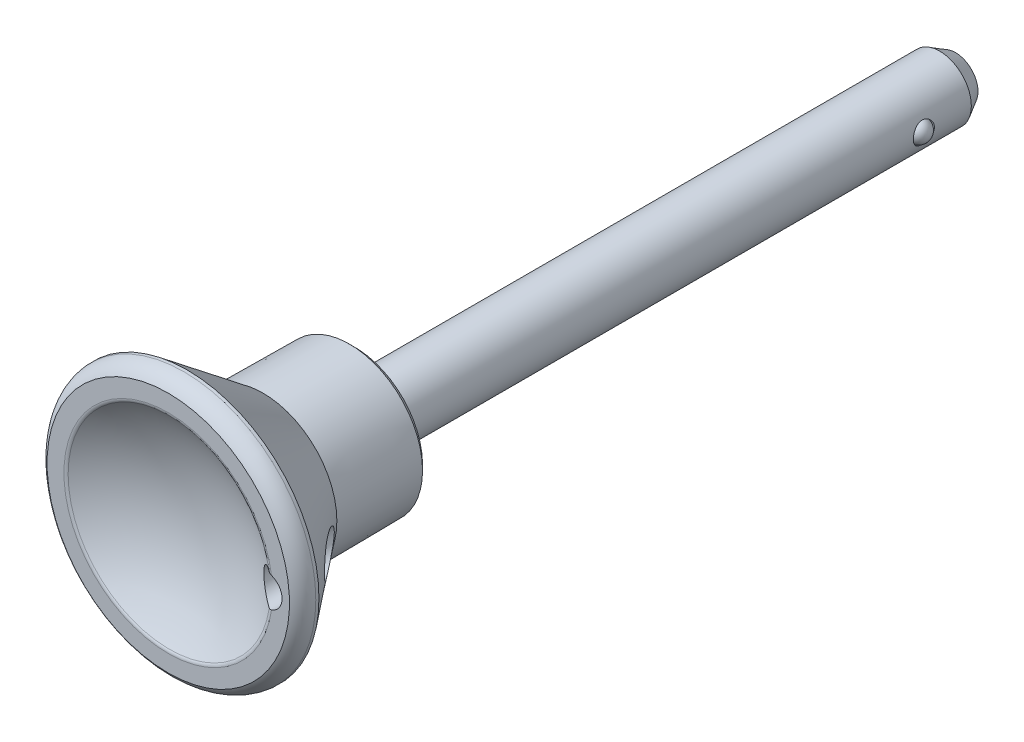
ISO-10303-21;
HEADER;
FILE_DESCRIPTION(('STEP AP214'),'2;1');
FILE_NAME('part.step','',(''),(''),'','','');
FILE_SCHEMA(('AUTOMOTIVE_DESIGN { 1 0 10303 214 1 1 1 1 }'));
ENDSEC;
DATA;
#1=APPLICATION_CONTEXT('core data for automotive mechanical design processes');
#2=APPLICATION_PROTOCOL_DEFINITION('international standard','automotive_design',2000,#1);
#3=PRODUCT_CONTEXT('',#1,'mechanical');
#4=PRODUCT('Part','Part','',(#3));
#5=PRODUCT_RELATED_PRODUCT_CATEGORY('part','',(#4));
#6=PRODUCT_DEFINITION_FORMATION('','',#4);
#7=PRODUCT_DEFINITION_CONTEXT('part definition',#1,'design');
#8=PRODUCT_DEFINITION('design','',#6,#7);
#9=PRODUCT_DEFINITION_SHAPE('','',#8);
#10=(LENGTH_UNIT() NAMED_UNIT(*) SI_UNIT(.MILLI.,.METRE.));
#11=(NAMED_UNIT(*) PLANE_ANGLE_UNIT() SI_UNIT($,.RADIAN.));
#12=(NAMED_UNIT(*) SI_UNIT($,.STERADIAN.) SOLID_ANGLE_UNIT());
#13=UNCERTAINTY_MEASURE_WITH_UNIT(LENGTH_MEASURE(1.E-05),#10,'distance_accuracy_value','');
#14=(GEOMETRIC_REPRESENTATION_CONTEXT(3) GLOBAL_UNCERTAINTY_ASSIGNED_CONTEXT((#13)) GLOBAL_UNIT_ASSIGNED_CONTEXT((#10,
#11,#12)) REPRESENTATION_CONTEXT('',''));
#15=CARTESIAN_POINT('',(0.,0.,0.));
#16=DIRECTION('',(0.,0.,1.));
#17=DIRECTION('',(1.,0.,0.));
#18=AXIS2_PLACEMENT_3D('',#15,#16,#17);
#19=CARTESIAN_POINT('',(0.,0.,0.));
#20=DIRECTION('',(0.,0.,1.));
#21=DIRECTION('',(0.,-1.,0.));
#22=AXIS2_PLACEMENT_3D('',#19,#20,#21);
#23=CYLINDRICAL_SURFACE('',#22,3.);
#24=CARTESIAN_POINT('',(0.,0.,0.));
#25=DIRECTION('',(0.,0.,1.));
#26=DIRECTION('',(0.,-1.,0.));
#27=AXIS2_PLACEMENT_3D('',#24,#25,#26);
#28=CIRCLE('',#27,3.);
#29=CARTESIAN_POINT('',(0.,-3.,0.));
#30=VERTEX_POINT('',#29);
#31=EDGE_CURVE('E18',#30,#30,#28,.T.);
#32=ORIENTED_EDGE('',*,*,#31,.F.);
#33=EDGE_LOOP('',(#32));
#34=FACE_BOUND('',#33,.T.);
#35=CARTESIAN_POINT('',(0.,0.,-55.5));
#36=DIRECTION('',(0.,0.,1.));
#37=DIRECTION('',(1.,0.,0.));
#38=AXIS2_PLACEMENT_3D('',#35,#36,#37);
#39=CIRCLE('',#38,3.);
#40=CARTESIAN_POINT('',(3.,0.,-55.5));
#41=VERTEX_POINT('',#40);
#42=EDGE_CURVE('E115',#41,#41,#39,.T.);
#43=ORIENTED_EDGE('',*,*,#42,.T.);
#44=EDGE_LOOP('',(#43));
#45=FACE_BOUND('',#44,.T.);
#46=CARTESIAN_POINT('',(3.,0.,-52.));
#47=CARTESIAN_POINT('',(2.99999782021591,-0.0544873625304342,-51.9999969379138));
#48=CARTESIAN_POINT('',(2.99849945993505,-0.109030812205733,-51.9955259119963));
#49=CARTESIAN_POINT('',(2.99265949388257,-0.216567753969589,-51.9777925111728));
#50=CARTESIAN_POINT('',(2.98831315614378,-0.269558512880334,-51.9645155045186));
#51=CARTESIAN_POINT('',(2.9772520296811,-0.372338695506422,-51.9296777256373));
#52=CARTESIAN_POINT('',(2.97054267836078,-0.422135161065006,-51.9081359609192));
#53=CARTESIAN_POINT('',(2.95544181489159,-0.517390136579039,-51.8574495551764));
#54=CARTESIAN_POINT('',(2.94705050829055,-0.562849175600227,-51.8283058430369));
#55=CARTESIAN_POINT('',(2.9291411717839,-0.649740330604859,-51.7621750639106));
#56=CARTESIAN_POINT('',(2.9195960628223,-0.691001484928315,-51.7249707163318));
#57=CARTESIAN_POINT('',(2.90060364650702,-0.766830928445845,-51.6442351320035));
#58=CARTESIAN_POINT('',(2.89115636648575,-0.801397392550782,-51.6007021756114));
#59=CARTESIAN_POINT('',(2.87313330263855,-0.863825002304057,-51.5070147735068));
#60=CARTESIAN_POINT('',(2.86459035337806,-0.891464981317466,-51.4567060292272));
#61=CARTESIAN_POINT('',(2.84975302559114,-0.937818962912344,-51.3518236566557));
#62=CARTESIAN_POINT('',(2.84345795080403,-0.956535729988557,-51.2972513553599));
#63=CARTESIAN_POINT('',(2.834113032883,-0.983873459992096,-51.187326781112));
#64=CARTESIAN_POINT('',(2.83096095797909,-0.992813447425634,-51.1320627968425));
#65=CARTESIAN_POINT('',(2.82795656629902,-1.00134112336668,-51.020736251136));
#66=CARTESIAN_POINT('',(2.82810323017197,-1.00093170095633,-50.9646739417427));
#67=CARTESIAN_POINT('',(2.83159014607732,-0.991019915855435,-50.8560634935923));
#68=CARTESIAN_POINT('',(2.83478414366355,-0.981933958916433,-50.8034718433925));
#69=CARTESIAN_POINT('',(2.84376655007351,-0.955606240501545,-50.7006068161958));
#70=CARTESIAN_POINT('',(2.84955528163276,-0.938363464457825,-50.6503337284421));
#71=CARTESIAN_POINT('',(2.86317929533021,-0.895938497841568,-50.5525859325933));
#72=CARTESIAN_POINT('',(2.87104608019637,-0.870632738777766,-50.5051694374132));
#73=CARTESIAN_POINT('',(2.88792606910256,-0.812887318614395,-50.4151267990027));
#74=CARTESIAN_POINT('',(2.89693954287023,-0.78044597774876,-50.3725017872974));
#75=CARTESIAN_POINT('',(2.91567165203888,-0.70735591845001,-50.2909155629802));
#76=CARTESIAN_POINT('',(2.92540257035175,-0.666367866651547,-50.2522605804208));
#77=CARTESIAN_POINT('',(2.94406631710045,-0.578354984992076,-50.1822794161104));
#78=CARTESIAN_POINT('',(2.95299879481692,-0.531327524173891,-50.1509564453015));
#79=CARTESIAN_POINT('',(2.96917806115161,-0.431907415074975,-50.0962803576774));
#80=CARTESIAN_POINT('',(2.97640595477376,-0.379463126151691,-50.073015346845));
#81=CARTESIAN_POINT('',(2.98821351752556,-0.271163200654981,-50.0357719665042));
#82=CARTESIAN_POINT('',(2.99279860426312,-0.215314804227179,-50.0217745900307));
#83=CARTESIAN_POINT('',(2.99719039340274,-0.132457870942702,-50.0084544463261));
#84=CARTESIAN_POINT('',(2.99824082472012,-0.106081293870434,-50.0052879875));
#85=CARTESIAN_POINT('',(2.9996461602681,-0.0531409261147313,-50.0010600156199));
#86=CARTESIAN_POINT('',(3.00000106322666,-0.026577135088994,-49.9999985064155));
#87=CARTESIAN_POINT('',(2.99999782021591,0.0544873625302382,-50.0000030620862));
#88=CARTESIAN_POINT('',(2.99849945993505,0.109030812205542,-50.0044740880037));
#89=CARTESIAN_POINT('',(2.99265949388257,0.216567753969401,-50.0222074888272));
#90=CARTESIAN_POINT('',(2.98831315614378,0.269558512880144,-50.0354844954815));
#91=CARTESIAN_POINT('',(2.9772520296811,0.372338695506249,-50.0703222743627));
#92=CARTESIAN_POINT('',(2.97054267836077,0.422135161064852,-50.0918640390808));
#93=CARTESIAN_POINT('',(2.95544181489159,0.517390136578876,-50.1425504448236));
#94=CARTESIAN_POINT('',(2.94705050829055,0.562849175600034,-50.1716941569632));
#95=CARTESIAN_POINT('',(2.9291411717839,0.64974033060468,-50.2378249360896));
#96=CARTESIAN_POINT('',(2.91959606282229,0.691001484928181,-50.2750292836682));
#97=CARTESIAN_POINT('',(2.900603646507,0.766830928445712,-50.3557648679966));
#98=CARTESIAN_POINT('',(2.89115636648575,0.801397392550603,-50.3992978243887));
#99=CARTESIAN_POINT('',(2.87313330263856,0.863825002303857,-50.4929852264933));
#100=CARTESIAN_POINT('',(2.86459035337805,0.891464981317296,-50.5432939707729));
#101=CARTESIAN_POINT('',(2.84975302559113,0.937818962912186,-50.6481763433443));
#102=CARTESIAN_POINT('',(2.84345795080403,0.956535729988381,-50.7027486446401));
#103=CARTESIAN_POINT('',(2.834113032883,0.983873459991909,-50.812673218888));
#104=CARTESIAN_POINT('',(2.83096095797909,0.992813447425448,-50.8679372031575));
#105=CARTESIAN_POINT('',(2.82795656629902,1.0013411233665,-50.979263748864));
#106=CARTESIAN_POINT('',(2.82810323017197,1.00093170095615,-51.0353260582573));
#107=CARTESIAN_POINT('',(2.83159014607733,0.991019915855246,-51.1439365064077));
#108=CARTESIAN_POINT('',(2.83478414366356,0.981933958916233,-51.1965281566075));
#109=CARTESIAN_POINT('',(2.84376655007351,0.955606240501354,-51.2993931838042));
#110=CARTESIAN_POINT('',(2.84955528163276,0.938363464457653,-51.349666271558));
#111=CARTESIAN_POINT('',(2.8631792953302,0.895938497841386,-51.4474140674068));
#112=CARTESIAN_POINT('',(2.87104608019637,0.87063273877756,-51.4948305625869));
#113=CARTESIAN_POINT('',(2.88792606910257,0.812887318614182,-51.5848732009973));
#114=CARTESIAN_POINT('',(2.89693954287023,0.780445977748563,-51.6274982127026));
#115=CARTESIAN_POINT('',(2.91567165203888,0.707355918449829,-51.7090844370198));
#116=CARTESIAN_POINT('',(2.92540257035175,0.666367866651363,-51.7477394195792));
#117=CARTESIAN_POINT('',(2.94406631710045,0.578354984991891,-51.8177205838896));
#118=CARTESIAN_POINT('',(2.95299879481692,0.531327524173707,-51.8490435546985));
#119=CARTESIAN_POINT('',(2.96917806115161,0.431907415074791,-51.9037196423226));
#120=CARTESIAN_POINT('',(2.97640595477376,0.379463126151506,-51.926984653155));
#121=CARTESIAN_POINT('',(2.98821351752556,0.271163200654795,-51.9642280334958));
#122=CARTESIAN_POINT('',(2.99279860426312,0.215314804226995,-51.9782254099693));
#123=CARTESIAN_POINT('',(2.99719039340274,0.132457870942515,-51.9915455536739));
#124=CARTESIAN_POINT('',(2.99824082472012,0.106081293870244,-51.9947120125));
#125=CARTESIAN_POINT('',(2.9996461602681,0.0531409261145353,-51.9989399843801));
#126=CARTESIAN_POINT('',(3.00000106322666,0.0265771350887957,-52.0000014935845));
#127=CARTESIAN_POINT('',(3.,0.,-52.));
#128=B_SPLINE_CURVE_WITH_KNOTS('',3,(#46,#47,#48,#49,#50,#51,#52,#53,#54,#55,#56,#57,#58,#59,
#60,#61,#62,#63,#64,#65,#66,#67,#68,#69,#70,#71,#72,#73,#74,#75,#76,#77,#78,#79,#80,#81,#82,#83,
#84,#85,#86,#87,#88,#89,#90,#91,#92,#93,#94,#95,#96,#97,#98,#99,#100,#101,#102,#103,#104,#105,
#106,#107,#108,#109,#110,#111,#112,#113,#114,#115,#116,#117,#118,#119,#120,#121,#122,#123,#124,
#125,#126,#127),.UNSPECIFIED.,.T.,.F.,(4,2,2,2,2,2,2,2,2,2,2,2,2,2,2,2,2,2,2,2,2,2,2,2,2,2,2,2,
2,2,2,2,2,2,2,2,2,2,2,2,4),(0.,0.16335953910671,0.326991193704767,0.490248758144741,
0.6534863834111,0.821842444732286,0.990244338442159,1.16348424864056,1.33667045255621,
1.50401925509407,1.67131634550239,1.83096789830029,1.99063931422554,2.152886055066,
2.31517103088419,2.48590393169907,2.65671146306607,2.82933165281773,3.00159671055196,
3.08127795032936,3.16095933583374,3.32431887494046,3.48795052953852,3.65120809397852,
3.81444571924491,3.9828017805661,4.15120367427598,4.32444358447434,4.49762978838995,
4.6649785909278,4.83227568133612,4.99192723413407,5.15159865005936,5.31384539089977,
5.47613036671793,5.6468632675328,5.81767079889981,5.99029098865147,6.1625560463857,
6.24223728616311,6.32191867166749),.UNSPECIFIED.);
#129=CARTESIAN_POINT('',(3.,0.,-52.));
#130=VERTEX_POINT('',#129);
#131=EDGE_CURVE('E159',#130,#130,#128,.T.);
#132=ORIENTED_EDGE('',*,*,#131,.T.);
#133=EDGE_LOOP('',(#132));
#134=FACE_BOUND('',#133,.T.);
#135=ADVANCED_FACE('F15',(#34,#45,#134),#23,.T.);
#136=CARTESIAN_POINT('',(6.4240762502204,-6.50116727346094,0.));
#137=DIRECTION('',(0.,0.,-1.));
#138=DIRECTION('',(-1.,0.,0.));
#139=AXIS2_PLACEMENT_3D('',#136,#137,#138);
#140=PLANE('',#139);
#141=ORIENTED_EDGE('',*,*,#31,.T.);
#142=EDGE_LOOP('',(#141));
#143=FACE_BOUND('',#142,.T.);
#144=CARTESIAN_POINT('',(0.,0.,0.));
#145=DIRECTION('',(0.,0.,1.));
#146=DIRECTION('',(0.,-1.,0.));
#147=AXIS2_PLACEMENT_3D('',#144,#145,#146);
#148=CIRCLE('',#147,6.4240762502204);
#149=CARTESIAN_POINT('',(0.,-6.4240762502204,0.));
#150=VERTEX_POINT('',#149);
#151=EDGE_CURVE('E103',#150,#150,#148,.T.);
#152=ORIENTED_EDGE('',*,*,#151,.F.);
#153=EDGE_LOOP('',(#152));
#154=FACE_BOUND('',#153,.T.);
#155=ADVANCED_FACE('F184',(#143,#154),#140,.T.);
#156=CARTESIAN_POINT('',(0.,0.,0.));
#157=DIRECTION('',(0.,0.,1.));
#158=DIRECTION('',(0.,-1.,0.));
#159=AXIS2_PLACEMENT_3D('',#156,#157,#158);
#160=CONICAL_SURFACE('',#159,6.4240762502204,0.789761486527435);
#161=CARTESIAN_POINT('',(0.,0.,0.499980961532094));
#162=DIRECTION('',(0.,0.,-1.));
#163=DIRECTION('',(1.,0.,0.));
#164=AXIS2_PLACEMENT_3D('',#161,#162,#163);
#165=CIRCLE('',#164,6.92843951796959);
#166=CARTESIAN_POINT('',(6.92843951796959,0.,0.499980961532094));
#167=VERTEX_POINT('',#166);
#168=EDGE_CURVE('E134',#167,#167,#165,.F.);
#169=ORIENTED_EDGE('',*,*,#168,.F.);
#170=EDGE_LOOP('',(#169));
#171=FACE_BOUND('',#170,.T.);
#172=ORIENTED_EDGE('',*,*,#151,.T.);
#173=EDGE_LOOP('',(#172));
#174=FACE_BOUND('',#173,.T.);
#175=ADVANCED_FACE('F189',(#171,#174),#160,.T.);
#176=CARTESIAN_POINT('',(0.,0.,0.499980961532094));
#177=DIRECTION('',(0.,0.,1.));
#178=DIRECTION('',(0.,-1.,0.));
#179=AXIS2_PLACEMENT_3D('',#176,#177,#178);
#180=CONICAL_SURFACE('',#179,6.92843951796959,0.00872664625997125);
#181=CARTESIAN_POINT('',(0.,0.,8.7));
#182=DIRECTION('',(0.,0.,-1.));
#183=DIRECTION('',(1.,0.,0.));
#184=AXIS2_PLACEMENT_3D('',#181,#182,#183);
#185=CIRCLE('',#184,7.);
#186=CARTESIAN_POINT('',(7.,0.,8.7));
#187=VERTEX_POINT('',#186);
#188=EDGE_CURVE('E129',#187,#187,#185,.F.);
#189=ORIENTED_EDGE('',*,*,#188,.F.);
#190=EDGE_LOOP('',(#189));
#191=FACE_BOUND('',#190,.T.);
#192=ORIENTED_EDGE('',*,*,#168,.T.);
#193=EDGE_LOOP('',(#192));
#194=FACE_BOUND('',#193,.T.);
#195=ADVANCED_FACE('F201',(#191,#194),#180,.T.);
#196=CARTESIAN_POINT('',(0.,0.,16.2));
#197=DIRECTION('',(0.,0.,1.));
#198=DIRECTION('',(0.,-1.,0.));
#199=AXIS2_PLACEMENT_3D('',#196,#197,#198);
#200=CYLINDRICAL_SURFACE('',#199,12.5);
#201=CARTESIAN_POINT('',(0.,0.,15.9));
#202=DIRECTION('',(0.,0.,-1.));
#203=DIRECTION('',(1.,0.,0.));
#204=AXIS2_PLACEMENT_3D('',#201,#202,#203);
#205=CIRCLE('',#204,12.5);
#206=CARTESIAN_POINT('',(12.5,0.,15.9));
#207=VERTEX_POINT('',#206);
#208=EDGE_CURVE('E130',#207,#207,#205,.T.);
#209=ORIENTED_EDGE('',*,*,#208,.F.);
#210=EDGE_LOOP('',(#209));
#211=FACE_BOUND('',#210,.T.);
#212=CARTESIAN_POINT('',(0.,0.,16.2));
#213=DIRECTION('',(0.,0.,1.));
#214=DIRECTION('',(0.,-1.,0.));
#215=AXIS2_PLACEMENT_3D('',#212,#213,#214);
#216=CIRCLE('',#215,12.5);
#217=CARTESIAN_POINT('',(0.,-12.5,16.2));
#218=VERTEX_POINT('',#217);
#219=EDGE_CURVE('E102',#218,#218,#216,.T.);
#220=ORIENTED_EDGE('',*,*,#219,.F.);
#221=EDGE_LOOP('',(#220));
#222=FACE_BOUND('',#221,.T.);
#223=ADVANCED_FACE('F208',(#211,#222),#200,.T.);
#224=CARTESIAN_POINT('',(0.,0.,8.7));
#225=DIRECTION('',(0.,0.,1.));
#226=DIRECTION('',(0.,-1.,0.));
#227=AXIS2_PLACEMENT_3D('',#224,#225,#226);
#228=CONICAL_SURFACE('',#227,7.,0.65233090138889);
#229=CARTESIAN_POINT('',(9.05806451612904,-1.48036050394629,11.5515077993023));
#230=CARTESIAN_POINT('',(8.99141512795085,-1.46946825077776,11.4631001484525));
#231=CARTESIAN_POINT('',(8.92550148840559,-1.45408557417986,11.3746905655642));
#232=CARTESIAN_POINT('',(8.7955636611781,-1.41427171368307,11.1984472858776));
#233=CARTESIAN_POINT('',(8.73154031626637,-1.38983655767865,11.1106138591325));
#234=CARTESIAN_POINT('',(8.60623315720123,-1.33170423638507,10.936758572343));
#235=CARTESIAN_POINT('',(8.54493725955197,-1.29805393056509,10.8507298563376));
#236=CARTESIAN_POINT('',(8.42544336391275,-1.22074353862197,10.6811358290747));
#237=CARTESIAN_POINT('',(8.36724184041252,-1.17709515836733,10.5975677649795));
#238=CARTESIAN_POINT('',(8.26922940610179,-1.09114708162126,10.4552980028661));
#239=CARTESIAN_POINT('',(8.22852162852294,-1.05135683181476,10.3957022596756));
#240=CARTESIAN_POINT('',(8.14989980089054,-0.964725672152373,10.2796936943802));
#241=CARTESIAN_POINT('',(8.11198828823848,-0.917878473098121,10.2232837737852));
#242=CARTESIAN_POINT('',(8.03963417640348,-0.81574430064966,10.1148327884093));
#243=CARTESIAN_POINT('',(8.00522654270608,-0.760383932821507,10.0628364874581));
#244=CARTESIAN_POINT('',(7.94192848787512,-0.640477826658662,9.96655825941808));
#245=CARTESIAN_POINT('',(7.91302454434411,-0.5759552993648,9.92225744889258));
#246=CARTESIAN_POINT('',(7.87251252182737,-0.463057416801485,9.85986137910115));
#247=CARTESIAN_POINT('',(7.85846623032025,-0.417573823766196,9.8381417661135));
#248=CARTESIAN_POINT('',(7.83441768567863,-0.323152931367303,9.80086955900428));
#249=CARTESIAN_POINT('',(7.82440740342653,-0.274222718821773,9.78530472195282));
#250=CARTESIAN_POINT('',(7.81132335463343,-0.187620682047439,9.76493500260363));
#251=CARTESIAN_POINT('',(7.80710048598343,-0.15053785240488,9.7583503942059));
#252=CARTESIAN_POINT('',(7.80143783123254,-0.075641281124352,9.74951765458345));
#253=CARTESIAN_POINT('',(7.79999798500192,-0.0378275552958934,9.7472694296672));
#254=CARTESIAN_POINT('',(7.8000025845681,0.0485200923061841,9.74727695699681));
#255=CARTESIAN_POINT('',(7.80237736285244,0.0970629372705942,9.75098545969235));
#256=CARTESIAN_POINT('',(7.81164444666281,0.192651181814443,9.76543406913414));
#257=CARTESIAN_POINT('',(7.81854204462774,0.239694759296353,9.77618241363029));
#258=CARTESIAN_POINT('',(7.83829683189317,0.341610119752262,9.80688772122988));
#259=CARTESIAN_POINT('',(7.85215507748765,0.395817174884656,9.82838678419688));
#260=CARTESIAN_POINT('',(7.8845198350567,0.499375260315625,9.87838349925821));
#261=CARTESIAN_POINT('',(7.90303499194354,0.548717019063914,9.9068941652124));
#262=CARTESIAN_POINT('',(7.95423062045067,0.667068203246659,9.98533549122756));
#263=CARTESIAN_POINT('',(7.98924354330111,0.732796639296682,10.0386516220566));
#264=CARTESIAN_POINT('',(8.06472209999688,0.853932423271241,10.1525776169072));
#265=CARTESIAN_POINT('',(8.10520064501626,0.909314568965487,10.2132047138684));
#266=CARTESIAN_POINT('',(8.18383548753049,1.00367842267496,10.3298982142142));
#267=CARTESIAN_POINT('',(8.22147534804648,1.04387385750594,10.3853483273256));
#268=CARTESIAN_POINT('',(8.29898008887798,1.1184153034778,10.4986148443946));
#269=CARTESIAN_POINT('',(8.33884646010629,1.15275733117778,10.556432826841));
#270=CARTESIAN_POINT('',(8.42042546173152,1.21614962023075,10.6737908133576));
#271=CARTESIAN_POINT('',(8.46214099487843,1.24519116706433,10.7333334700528));
#272=CARTESIAN_POINT('',(8.54706483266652,1.29830522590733,10.8535675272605));
#273=CARTESIAN_POINT('',(8.59027353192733,1.32237641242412,10.9142592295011));
#274=CARTESIAN_POINT('',(8.69675324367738,1.37513054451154,11.0626135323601));
#275=CARTESIAN_POINT('',(8.7606819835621,1.40136483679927,11.150681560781));
#276=CARTESIAN_POINT('',(8.89058399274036,1.44466814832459,11.3275915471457));
#277=CARTESIAN_POINT('',(8.95655819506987,1.46173291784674,11.4164338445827));
#278=CARTESIAN_POINT('',(9.09008194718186,1.48679092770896,11.5942301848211));
#279=CARTESIAN_POINT('',(9.15763151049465,1.49478409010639,11.683184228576));
#280=CARTESIAN_POINT('',(9.293788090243,1.50153429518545,11.8605390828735));
#281=CARTESIAN_POINT('',(9.36239469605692,1.50029483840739,11.9489400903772));
#282=CARTESIAN_POINT('',(9.53896432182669,1.48478544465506,12.1740527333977));
#283=CARTESIAN_POINT('',(9.64741582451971,1.46359594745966,12.3100469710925));
#284=CARTESIAN_POINT('',(9.80896256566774,1.41213790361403,12.5095339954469));
#285=CARTESIAN_POINT('',(9.86259038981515,1.39172486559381,12.5752398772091));
#286=CARTESIAN_POINT('',(9.96902195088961,1.34380635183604,12.7046889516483));
#287=CARTESIAN_POINT('',(10.021826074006,1.31630431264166,12.7684330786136));
#288=CARTESIAN_POINT('',(10.1398540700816,1.24522266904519,12.9099256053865));
#289=CARTESIAN_POINT('',(10.2046458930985,1.1993124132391,12.9868895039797));
#290=CARTESIAN_POINT('',(10.3299573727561,1.09357010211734,13.1345591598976));
#291=CARTESIAN_POINT('',(10.3904821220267,1.03375502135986,13.2052724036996));
#292=CARTESIAN_POINT('',(10.4895745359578,0.916081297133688,13.3202576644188));
#293=CARTESIAN_POINT('',(10.5297805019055,0.861692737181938,13.3666468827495));
#294=CARTESIAN_POINT('',(10.6043536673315,0.743973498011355,13.452316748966));
#295=CARTESIAN_POINT('',(10.6387288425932,0.680655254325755,13.4916071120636));
#296=CARTESIAN_POINT('',(10.6925693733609,0.560424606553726,13.5529446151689));
#297=CARTESIAN_POINT('',(10.7136506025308,0.505208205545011,13.5768833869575));
#298=CARTESIAN_POINT('',(10.7495749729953,0.390302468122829,13.6176027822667));
#299=CARTESIAN_POINT('',(10.7644289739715,0.330621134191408,13.6343958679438));
#300=CARTESIAN_POINT('',(10.7836092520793,0.225596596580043,13.656059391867));
#301=CARTESIAN_POINT('',(10.7897268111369,0.180990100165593,13.6629607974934));
#302=CARTESIAN_POINT('',(10.7979243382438,0.0909301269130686,13.6722061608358));
#303=CARTESIAN_POINT('',(10.8000037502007,0.0454765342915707,13.6745494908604));
#304=CARTESIAN_POINT('',(10.799994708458,-0.0641674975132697,13.6745397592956));
#305=CARTESIAN_POINT('',(10.795841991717,-0.128380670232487,13.6698606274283));
#306=CARTESIAN_POINT('',(10.7796239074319,-0.254506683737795,13.6515601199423));
#307=CARTESIAN_POINT('',(10.7675483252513,-0.31641644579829,13.6379272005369));
#308=CARTESIAN_POINT('',(10.7366563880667,-0.435644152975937,13.6029693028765));
#309=CARTESIAN_POINT('',(10.7178919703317,-0.492993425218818,13.5817035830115));
#310=CARTESIAN_POINT('',(10.6748799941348,-0.602645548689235,13.532811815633));
#311=CARTESIAN_POINT('',(10.6506301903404,-0.654946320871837,13.5051831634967));
#312=CARTESIAN_POINT('',(10.5859735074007,-0.77647271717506,13.4312530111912));
#313=CARTESIAN_POINT('',(10.5432056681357,-0.842728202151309,13.3821425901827));
#314=CARTESIAN_POINT('',(10.4516580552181,-0.964099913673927,13.2763616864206));
#315=CARTESIAN_POINT('',(10.4028645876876,-1.01918998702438,13.2196739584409));
#316=CARTESIAN_POINT('',(10.2766029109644,-1.14345503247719,13.0719673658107));
#317=CARTESIAN_POINT('',(10.1967753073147,-1.20635475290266,12.9777102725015));
#318=CARTESIAN_POINT('',(10.0329696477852,-1.31236147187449,12.7820645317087));
#319=CARTESIAN_POINT('',(9.94898466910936,-1.35543413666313,12.6806638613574));
#320=CARTESIAN_POINT('',(9.79718248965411,-1.41705079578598,12.4951419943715));
#321=CARTESIAN_POINT('',(9.72964852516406,-1.43883766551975,12.4118303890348));
#322=CARTESIAN_POINT('',(9.59439459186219,-1.47247845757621,12.2433068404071));
#323=CARTESIAN_POINT('',(9.52667453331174,-1.48432617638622,12.1580937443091));
#324=CARTESIAN_POINT('',(9.39151350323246,-1.49875216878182,11.9862568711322));
#325=CARTESIAN_POINT('',(9.32407407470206,-1.50130123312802,11.8996295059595));
#326=CARTESIAN_POINT('',(9.19020636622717,-1.49747387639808,11.725837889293));
#327=CARTESIAN_POINT('',(9.12377782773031,-1.49109977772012,11.6386737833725));
#328=CARTESIAN_POINT('',(9.05806451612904,-1.48036050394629,11.5515077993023));
#329=B_SPLINE_CURVE_WITH_KNOTS('',3,(#229,#230,#231,#232,#233,#234,#235,#236,#237,#238,#239,
#240,#241,#242,#243,#244,#245,#246,#247,#248,#249,#250,#251,#252,#253,#254,#255,#256,#257,#258,
#259,#260,#261,#262,#263,#264,#265,#266,#267,#268,#269,#270,#271,#272,#273,#274,#275,#276,#277,
#278,#279,#280,#281,#282,#283,#284,#285,#286,#287,#288,#289,#290,#291,#292,#293,#294,#295,#296,
#297,#298,#299,#300,#301,#302,#303,#304,#305,#306,#307,#308,#309,#310,#311,#312,#313,#314,#315,
#316,#317,#318,#319,#320,#321,#322,#323,#324,#325,#326,#327,#328),.UNSPECIFIED.,.T.,.F.,(4,2,2,
2,2,2,2,2,2,2,2,2,2,2,2,2,2,2,2,2,2,2,2,2,2,2,2,2,2,2,2,2,2,2,2,2,2,2,2,2,2,2,2,2,2,2,2,2,2,4),
(0.,0.333658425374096,0.667463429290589,0.999601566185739,1.33135280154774,1.57826788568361,
1.82540433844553,2.07480511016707,2.32358497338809,2.48005639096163,2.63621497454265,
2.74958301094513,2.86294859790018,3.00835870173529,3.15393926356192,3.33275537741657,
3.51190592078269,3.78514778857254,4.05904679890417,4.2931693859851,4.52745067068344,
4.76211373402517,4.9968392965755,5.33221840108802,5.66775280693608,6.0032900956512,
6.33870017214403,6.86226215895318,7.12372139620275,7.38505412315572,7.71589293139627,
8.04632996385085,8.29159071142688,8.53651321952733,8.72709088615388,8.91733480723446,
9.0535973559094,9.18987866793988,9.3821719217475,9.57471358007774,9.76579164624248,
9.95694806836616,10.2340958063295,10.5118854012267,10.9254412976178,11.3397106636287,
11.6675345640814,11.995562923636,12.3246208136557,12.6535930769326),.UNSPECIFIED.);
#330=CARTESIAN_POINT('',(9.05806451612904,-1.48036050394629,11.5515077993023));
#331=VERTEX_POINT('',#330);
#332=EDGE_CURVE('E52',#331,#331,#329,.T.);
#333=ORIENTED_EDGE('',*,*,#332,.F.);
#334=EDGE_LOOP('',(#333));
#335=FACE_BOUND('',#334,.T.);
#336=ORIENTED_EDGE('',*,*,#208,.T.);
#337=EDGE_LOOP('',(#336));
#338=FACE_BOUND('',#337,.T.);
#339=ORIENTED_EDGE('',*,*,#188,.T.);
#340=EDGE_LOOP('',(#339));
#341=FACE_BOUND('',#340,.T.);
#342=ADVANCED_FACE('F211',(#335,#338,#341),#228,.T.);
#343=CARTESIAN_POINT('',(0.,0.,15.9596620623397));
#344=DIRECTION('',(0.,0.,1.));
#345=DIRECTION('',(0.,-1.,0.));
#346=AXIS2_PLACEMENT_3D('',#343,#344,#345);
#347=TOROIDAL_SURFACE('',#346,10.5144930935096,2.);
#348=ORIENTED_EDGE('',*,*,#219,.T.);
#349=EDGE_LOOP('',(#348));
#350=FACE_BOUND('',#349,.T.);
#351=CARTESIAN_POINT('',(0.,0.,17.7));
#352=DIRECTION('',(0.,0.,1.));
#353=DIRECTION('',(0.,-1.,0.));
#354=AXIS2_PLACEMENT_3D('',#351,#352,#353);
#355=CIRCLE('',#354,11.5);
#356=CARTESIAN_POINT('',(0.,-11.5,17.7));
#357=VERTEX_POINT('',#356);
#358=EDGE_CURVE('E57',#357,#357,#355,.T.);
#359=ORIENTED_EDGE('',*,*,#358,.F.);
#360=EDGE_LOOP('',(#359));
#361=FACE_BOUND('',#360,.T.);
#362=ADVANCED_FACE('F86',(#350,#361),#347,.T.);
#363=CARTESIAN_POINT('',(9.3,0.,9.7468824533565));
#364=DIRECTION('',(0.,0.,1.));
#365=DIRECTION('',(0.,-1.,0.));
#366=AXIS2_PLACEMENT_3D('',#363,#364,#365);
#367=CYLINDRICAL_SURFACE('',#366,1.5);
#368=ORIENTED_EDGE('',*,*,#332,.T.);
#369=EDGE_LOOP('',(#368));
#370=FACE_BOUND('',#369,.T.);
#371=CARTESIAN_POINT('',(9.79838709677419,-1.41478277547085,17.7));
#372=CARTESIAN_POINT('',(9.76967463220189,-1.42493393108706,17.7000278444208));
#373=CARTESIAN_POINT('',(9.74057958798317,-1.43416331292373,17.6978154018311));
#374=CARTESIAN_POINT('',(9.68339626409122,-1.45046247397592,17.688811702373));
#375=CARTESIAN_POINT('',(9.65530246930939,-1.45758512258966,17.6821493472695));
#376=CARTESIAN_POINT('',(9.60265119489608,-1.46937623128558,17.6649718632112));
#377=CARTESIAN_POINT('',(9.5780018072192,-1.47420693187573,17.6548534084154));
#378=CARTESIAN_POINT('',(9.52973678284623,-1.48251466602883,17.6305344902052));
#379=CARTESIAN_POINT('',(9.50616459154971,-1.48595330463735,17.6162348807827));
#380=CARTESIAN_POINT('',(9.48387096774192,-1.48868783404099,17.6));
#381=B_SPLINE_CURVE_WITH_KNOTS('',3,(#371,#372,#373,#374,#375,#376,#377,#378,#379,#380),
.UNSPECIFIED.,.F.,.F.,(4,2,2,2,4),(0.,0.0913475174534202,0.180157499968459,0.261045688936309,
0.344033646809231),.UNSPECIFIED.);
#382=CARTESIAN_POINT('',(9.79838709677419,-1.41478277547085,17.7));
#383=VERTEX_POINT('',#382);
#384=CARTESIAN_POINT('',(9.48387096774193,-1.48868783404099,17.6));
#385=VERTEX_POINT('',#384);
#386=EDGE_CURVE('E44',#383,#385,#381,.T.);
#387=ORIENTED_EDGE('',*,*,#386,.F.);
#388=CARTESIAN_POINT('',(9.3,0.,17.7));
#389=DIRECTION('',(0.,0.,1.));
#390=DIRECTION('',(0.,-1.,0.));
#391=AXIS2_PLACEMENT_3D('',#388,#389,#390);
#392=CIRCLE('',#391,1.5);
#393=CARTESIAN_POINT('',(9.79838709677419,1.41478277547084,17.7));
#394=VERTEX_POINT('',#393);
#395=EDGE_CURVE('E32',#394,#383,#392,.F.);
#396=ORIENTED_EDGE('',*,*,#395,.F.);
#397=CARTESIAN_POINT('',(9.79838709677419,1.41478277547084,17.7));
#398=CARTESIAN_POINT('',(9.76967463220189,1.42493393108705,17.7000278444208));
#399=CARTESIAN_POINT('',(9.74057958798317,1.43416331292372,17.6978154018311));
#400=CARTESIAN_POINT('',(9.68339626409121,1.45046247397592,17.688811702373));
#401=CARTESIAN_POINT('',(9.65530246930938,1.45758512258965,17.6821493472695));
#402=CARTESIAN_POINT('',(9.60265119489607,1.46937623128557,17.6649718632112));
#403=CARTESIAN_POINT('',(9.57800180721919,1.47420693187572,17.6548534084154));
#404=CARTESIAN_POINT('',(9.52973678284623,1.48251466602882,17.6305344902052));
#405=CARTESIAN_POINT('',(9.50616459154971,1.48595330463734,17.6162348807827));
#406=CARTESIAN_POINT('',(9.48387096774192,1.48868783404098,17.6));
#407=B_SPLINE_CURVE_WITH_KNOTS('',3,(#397,#398,#399,#400,#401,#402,#403,#404,#405,#406),
.UNSPECIFIED.,.F.,.F.,(4,2,2,2,4),(0.,0.0913475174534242,0.180157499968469,0.261045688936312,
0.344033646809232),.UNSPECIFIED.);
#408=CARTESIAN_POINT('',(9.48387096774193,1.48868783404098,17.6));
#409=VERTEX_POINT('',#408);
#410=EDGE_CURVE('E45',#394,#409,#407,.T.);
#411=ORIENTED_EDGE('',*,*,#410,.T.);
#412=CARTESIAN_POINT('',(9.48387096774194,-1.48868783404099,17.6));
#413=CARTESIAN_POINT('',(9.3818144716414,-1.50126046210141,17.5258231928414));
#414=CARTESIAN_POINT('',(9.27847034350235,-1.50339409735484,17.4514075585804));
#415=CARTESIAN_POINT('',(9.07150168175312,-1.48616897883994,17.3036113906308));
#416=CARTESIAN_POINT('',(8.96788247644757,-1.46662385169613,17.2302454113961));
#417=CARTESIAN_POINT('',(8.76570217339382,-1.40554015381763,17.0882393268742));
#418=CARTESIAN_POINT('',(8.66709675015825,-1.36425592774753,17.0195547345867));
#419=CARTESIAN_POINT('',(8.47807170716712,-1.25938003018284,16.8888158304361));
#420=CARTESIAN_POINT('',(8.3876187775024,-1.19588484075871,16.8267343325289));
#421=CARTESIAN_POINT('',(8.24568836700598,-1.0697955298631,16.7298945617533));
#422=CARTESIAN_POINT('',(8.19079097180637,-1.01295594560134,16.692612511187));
#423=CARTESIAN_POINT('',(8.08925811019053,-0.889102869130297,16.6238983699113));
#424=CARTESIAN_POINT('',(8.04262373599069,-0.82208803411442,16.5924670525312));
#425=CARTESIAN_POINT('',(7.95961243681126,-0.678453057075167,16.5366671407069));
#426=CARTESIAN_POINT('',(7.92332116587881,-0.601759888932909,16.5123574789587));
#427=CARTESIAN_POINT('',(7.86387797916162,-0.441385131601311,16.4726071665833));
#428=CARTESIAN_POINT('',(7.84069382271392,-0.357721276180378,16.4571447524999));
#429=CARTESIAN_POINT('',(7.81665644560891,-0.227526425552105,16.4411240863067));
#430=CARTESIAN_POINT('',(7.81042627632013,-0.182354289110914,16.436974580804));
#431=CARTESIAN_POINT('',(7.80209606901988,-0.0914654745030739,16.4314273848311));
#432=CARTESIAN_POINT('',(7.79999581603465,-0.0457488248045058,16.4300295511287));
#433=CARTESIAN_POINT('',(7.8000067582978,0.0738974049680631,16.4300365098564));
#434=CARTESIAN_POINT('',(7.80550430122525,0.147878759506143,16.4336949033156));
#435=CARTESIAN_POINT('',(7.82172596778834,0.257047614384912,16.4445026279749));
#436=CARTESIAN_POINT('',(7.82847272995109,0.293170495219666,16.4489987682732));
#437=CARTESIAN_POINT('',(7.84452794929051,0.364609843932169,16.4597055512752));
#438=CARTESIAN_POINT('',(7.85383787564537,0.399925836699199,16.4659171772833));
#439=CARTESIAN_POINT('',(7.88533418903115,0.503926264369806,16.4869492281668));
#440=CARTESIAN_POINT('',(7.91114789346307,0.571060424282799,16.5042071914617));
#441=CARTESIAN_POINT('',(7.97122958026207,0.699580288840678,16.5444764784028));
#442=CARTESIAN_POINT('',(8.00550445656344,0.760961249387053,16.5674924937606));
#443=CARTESIAN_POINT('',(8.06330229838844,0.849663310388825,16.6064232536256));
#444=CARTESIAN_POINT('',(8.08431449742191,0.879441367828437,16.6205962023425));
#445=CARTESIAN_POINT('',(8.12808579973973,0.936974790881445,16.6501700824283));
#446=CARTESIAN_POINT('',(8.15084283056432,0.964732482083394,16.6655695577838));
#447=CARTESIAN_POINT('',(8.22150377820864,1.04495101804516,16.7134720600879));
#448=CARTESIAN_POINT('',(8.27178709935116,1.09434151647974,16.7476721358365));
#449=CARTESIAN_POINT('',(8.38550726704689,1.19170689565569,16.8253434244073));
#450=CARTESIAN_POINT('',(8.4497664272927,1.23822096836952,16.8694253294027));
#451=CARTESIAN_POINT('',(8.58287694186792,1.31978473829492,16.961227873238));
#452=CARTESIAN_POINT('',(8.65173257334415,1.35482357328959,17.008951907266));
#453=CARTESIAN_POINT('',(8.76337185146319,1.40144242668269,17.0867690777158));
#454=CARTESIAN_POINT('',(8.80522580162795,1.41674274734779,17.1160369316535));
#455=CARTESIAN_POINT('',(8.88962205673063,1.44344948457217,17.1752539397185));
#456=CARTESIAN_POINT('',(8.93216367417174,1.45485956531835,17.2052024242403));
#457=CARTESIAN_POINT('',(9.0604835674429,1.4833442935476,17.2958544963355));
#458=CARTESIAN_POINT('',(9.14699642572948,1.4946896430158,17.3573922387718));
#459=CARTESIAN_POINT('',(9.31725275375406,1.50223877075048,17.4793658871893));
#460=CARTESIAN_POINT('',(9.4009955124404,1.49891929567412,17.539773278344));
#461=CARTESIAN_POINT('',(9.48387096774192,1.4886878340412,17.6));
#462=B_SPLINE_CURVE_WITH_KNOTS('',3,(#412,#413,#414,#415,#416,#417,#418,#419,#420,#421,#422,
#423,#424,#425,#426,#427,#428,#429,#430,#431,#432,#433,#434,#435,#436,#437,#438,#439,#440,#441,
#442,#443,#444,#445,#446,#447,#448,#449,#450,#451,#452,#453,#454,#455,#456,#457,#458,#459,#460,
#461),.UNSPECIFIED.,.F.,.F.,(4,2,2,2,2,2,2,2,2,2,2,2,2,2,2,2,2,2,2,2,2,2,2,2,4),(0.,
0.380173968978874,0.763641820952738,1.14271969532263,1.52017093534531,1.7812816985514,
2.0424269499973,2.3056758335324,2.56827433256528,2.70539664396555,2.84251181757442,
3.06399194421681,3.17494513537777,3.28596205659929,3.50680011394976,3.72781870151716,
3.84503226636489,3.96210870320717,4.19632161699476,4.46759731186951,4.73912905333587,
4.89893578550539,5.05859157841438,5.37775215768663,5.68661469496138),.UNSPECIFIED.);
#463=EDGE_CURVE('E50',#385,#409,#462,.T.);
#464=ORIENTED_EDGE('',*,*,#463,.F.);
#465=EDGE_LOOP('',(#387,#396,#411,#464));
#466=FACE_BOUND('',#465,.T.);
#467=ADVANCED_FACE('F48',(#370,#466),#367,.F.);
#468=CARTESIAN_POINT('',(0.,0.,30.4));
#469=DIRECTION('',(0.,-1.,0.));
#470=DIRECTION('',(0.,0.,1.));
#471=AXIS2_PLACEMENT_3D('',#468,#469,#470);
#472=SPHERICAL_SURFACE('',#471,16.);
#473=ORIENTED_EDGE('',*,*,#463,.T.);
#474=CARTESIAN_POINT('',(0.,0.,17.6));
#475=DIRECTION('',(0.,0.,1.));
#476=DIRECTION('',(0.,-1.,0.));
#477=AXIS2_PLACEMENT_3D('',#474,#475,#476);
#478=CIRCLE('',#477,9.6);
#479=EDGE_CURVE('E25',#385,#409,#478,.F.);
#480=ORIENTED_EDGE('',*,*,#479,.F.);
#481=EDGE_LOOP('',(#473,#480));
#482=FACE_BOUND('',#481,.T.);
#483=ADVANCED_FACE('F79',(#482),#472,.F.);
#484=CARTESIAN_POINT('',(-11.73,-11.4999999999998,17.7));
#485=CARTESIAN_POINT('',(-11.5,-11.4999999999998,17.7));
#486=CARTESIAN_POINT('',(11.5,-11.4999999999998,17.7));
#487=B_SPLINE_CURVE_WITH_KNOTS('',1,(#484,#485,#486),.UNSPECIFIED.,.F.,.F.,(2,1,2),(-0.01,0.,
1.),.UNSPECIFIED.);
#488=DIRECTION('',(0.,1.,0.));
#489=VECTOR('',#488,1.);
#490=SURFACE_OF_LINEAR_EXTRUSION('',#487,#489);
#491=ORIENTED_EDGE('',*,*,#395,.T.);
#492=CARTESIAN_POINT('',(0.,0.,17.7));
#493=DIRECTION('',(0.,0.,1.));
#494=DIRECTION('',(0.,-1.,0.));
#495=AXIS2_PLACEMENT_3D('',#492,#493,#494);
#496=CIRCLE('',#495,9.9);
#497=EDGE_CURVE('E9',#394,#383,#496,.T.);
#498=ORIENTED_EDGE('',*,*,#497,.F.);
#499=EDGE_LOOP('',(#491,#498));
#500=FACE_BOUND('',#499,.T.);
#501=ORIENTED_EDGE('',*,*,#358,.T.);
#502=EDGE_LOOP('',(#501));
#503=FACE_BOUND('',#502,.T.);
#504=ADVANCED_FACE('F54',(#500,#503),#490,.T.);
#505=CARTESIAN_POINT('',(0.,0.,17.2));
#506=DIRECTION('',(0.,0.,1.));
#507=DIRECTION('',(0.,-1.,0.));
#508=AXIS2_PLACEMENT_3D('',#505,#506,#507);
#509=TOROIDAL_SURFACE('',#508,9.89999999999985,0.50000000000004);
#510=ORIENTED_EDGE('',*,*,#410,.F.);
#511=ORIENTED_EDGE('',*,*,#497,.T.);
#512=ORIENTED_EDGE('',*,*,#386,.T.);
#513=ORIENTED_EDGE('',*,*,#479,.T.);
#514=EDGE_LOOP('',(#510,#511,#512,#513));
#515=FACE_BOUND('',#514,.T.);
#516=ADVANCED_FACE('F42',(#515),#509,.T.);
#517=CARTESIAN_POINT('',(2.49,0.,-51.));
#518=DIRECTION('',(0.,-1.,0.));
#519=DIRECTION('',(0.,0.,-1.));
#520=AXIS2_PLACEMENT_3D('',#517,#518,#519);
#521=SPHERICAL_SURFACE('',#520,1.01);
#522=CARTESIAN_POINT('',(2.63177446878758,0.,-51.));
#523=DIRECTION('',(1.,0.,0.));
#524=DIRECTION('',(0.,-1.,0.));
#525=AXIS2_PLACEMENT_3D('',#522,#523,#524);
#526=CIRCLE('',#525,1.);
#527=CARTESIAN_POINT('',(2.63177446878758,-1.00000000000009,-51.));
#528=VERTEX_POINT('',#527);
#529=EDGE_CURVE('E148',#528,#528,#526,.F.);
#530=ORIENTED_EDGE('',*,*,#529,.F.);
#531=EDGE_LOOP('',(#530));
#532=FACE_BOUND('',#531,.T.);
#533=ADVANCED_FACE('F108',(#532),#521,.T.);
#534=CARTESIAN_POINT('',(2.13397459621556,-2.15958441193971,-57.));
#535=DIRECTION('',(0.,0.,-1.));
#536=DIRECTION('',(-1.,0.,0.));
#537=AXIS2_PLACEMENT_3D('',#534,#535,#536);
#538=PLANE('',#537);
#539=CARTESIAN_POINT('',(0.,0.,-57.));
#540=DIRECTION('',(0.,0.,1.));
#541=DIRECTION('',(0.,-1.,0.));
#542=AXIS2_PLACEMENT_3D('',#539,#540,#541);
#543=CIRCLE('',#542,2.13397459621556);
#544=CARTESIAN_POINT('',(0.,-2.13397459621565,-57.));
#545=VERTEX_POINT('',#544);
#546=EDGE_CURVE('E153',#545,#545,#543,.T.);
#547=ORIENTED_EDGE('',*,*,#546,.F.);
#548=EDGE_LOOP('',(#547));
#549=FACE_BOUND('',#548,.T.);
#550=ADVANCED_FACE('F174',(#549),#538,.T.);
#551=CARTESIAN_POINT('',(2.63177446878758,0.,-51.));
#552=DIRECTION('',(1.,0.,0.));
#553=DIRECTION('',(0.,-1.,0.));
#554=AXIS2_PLACEMENT_3D('',#551,#552,#553);
#555=CYLINDRICAL_SURFACE('',#554,1.);
#556=ORIENTED_EDGE('',*,*,#529,.T.);
#557=EDGE_LOOP('',(#556));
#558=FACE_BOUND('',#557,.T.);
#559=ORIENTED_EDGE('',*,*,#131,.F.);
#560=EDGE_LOOP('',(#559));
#561=FACE_BOUND('',#560,.T.);
#562=ADVANCED_FACE('F169',(#558,#561),#555,.F.);
#563=CARTESIAN_POINT('',(0.,0.,-57.));
#564=DIRECTION('',(0.,0.,1.));
#565=DIRECTION('',(0.,-1.,0.));
#566=AXIS2_PLACEMENT_3D('',#563,#564,#565);
#567=CONICAL_SURFACE('',#566,2.13397459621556,0.523598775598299);
#568=ORIENTED_EDGE('',*,*,#42,.F.);
#569=EDGE_LOOP('',(#568));
#570=FACE_BOUND('',#569,.T.);
#571=ORIENTED_EDGE('',*,*,#546,.T.);
#572=EDGE_LOOP('',(#571));
#573=FACE_BOUND('',#572,.T.);
#574=ADVANCED_FACE('F173',(#570,#573),#567,.T.);
#575=CLOSED_SHELL('',(#135,#155,#175,#195,#223,#342,#362,#467,#483,#504,#516,#533,#550,#562,#574));
#576=MANIFOLD_SOLID_BREP('B1',#575);
#577=ADVANCED_BREP_SHAPE_REPRESENTATION('',(#18,#576),#14);
#578=SHAPE_DEFINITION_REPRESENTATION(#9,#577);
ENDSEC;
END-ISO-10303-21;
